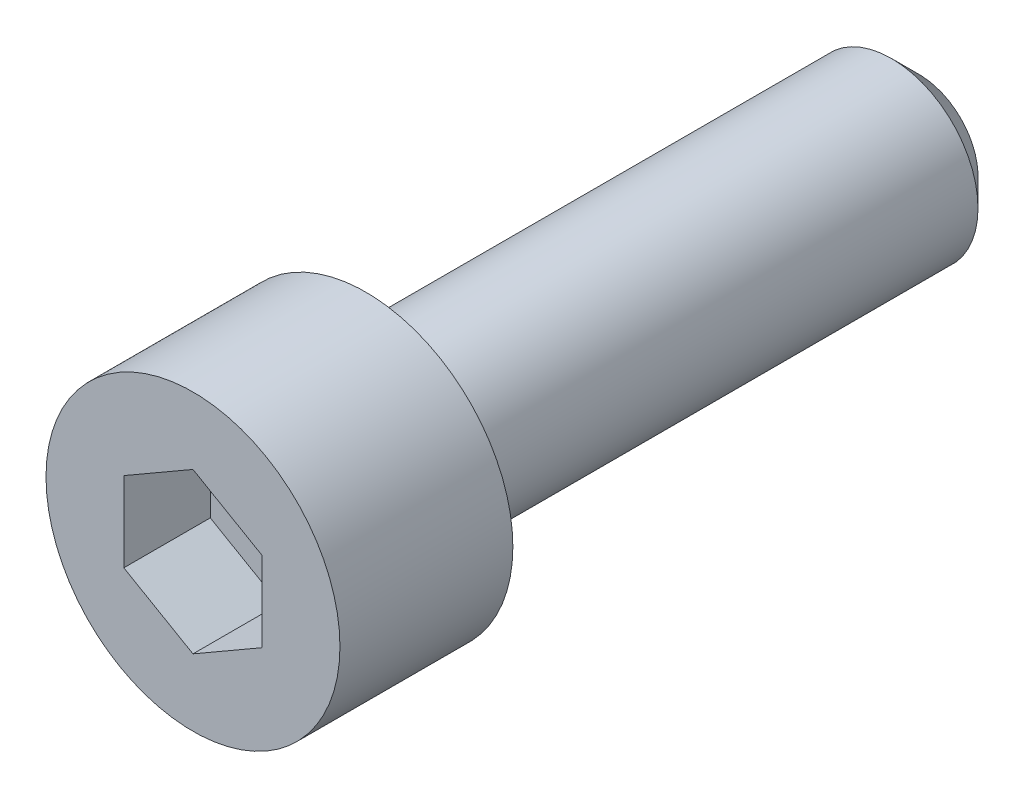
ISO-10303-21;
HEADER;
FILE_DESCRIPTION(('STEP AP214'),'2;1');
FILE_NAME('part.step','',(''),(''),'','','');
FILE_SCHEMA(('AUTOMOTIVE_DESIGN { 1 0 10303 214 1 1 1 1 }'));
ENDSEC;
DATA;
#1=APPLICATION_CONTEXT('core data for automotive mechanical design processes');
#2=APPLICATION_PROTOCOL_DEFINITION('international standard','automotive_design',2000,#1);
#3=PRODUCT_CONTEXT('',#1,'mechanical');
#4=PRODUCT('Part','Part','',(#3));
#5=PRODUCT_RELATED_PRODUCT_CATEGORY('part','',(#4));
#6=PRODUCT_DEFINITION_FORMATION('','',#4);
#7=PRODUCT_DEFINITION_CONTEXT('part definition',#1,'design');
#8=PRODUCT_DEFINITION('design','',#6,#7);
#9=PRODUCT_DEFINITION_SHAPE('','',#8);
#10=(LENGTH_UNIT() NAMED_UNIT(*) SI_UNIT(.MILLI.,.METRE.));
#11=(NAMED_UNIT(*) PLANE_ANGLE_UNIT() SI_UNIT($,.RADIAN.));
#12=(NAMED_UNIT(*) SI_UNIT($,.STERADIAN.) SOLID_ANGLE_UNIT());
#13=UNCERTAINTY_MEASURE_WITH_UNIT(LENGTH_MEASURE(1.E-05),#10,'distance_accuracy_value','');
#14=(GEOMETRIC_REPRESENTATION_CONTEXT(3) GLOBAL_UNCERTAINTY_ASSIGNED_CONTEXT((#13)) GLOBAL_UNIT_ASSIGNED_CONTEXT((#10,
#11,#12)) REPRESENTATION_CONTEXT('',''));
#15=CARTESIAN_POINT('',(0.,0.,0.));
#16=DIRECTION('',(0.,0.,1.));
#17=DIRECTION('',(1.,0.,0.));
#18=AXIS2_PLACEMENT_3D('',#15,#16,#17);
#19=CARTESIAN_POINT('',(0.,2.3094010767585,2.5));
#20=DIRECTION('',(-0.5,-0.86602540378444,0.));
#21=DIRECTION('',(0.86602540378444,-0.5,0.));
#22=AXIS2_PLACEMENT_3D('',#19,#20,#21);
#23=PLANE('',#22);
#24=DIRECTION('',(0.,0.,1.));
#25=VECTOR('',#24,1.);
#26=CARTESIAN_POINT('',(2.,1.15470053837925,2.5));
#27=LINE('',#26,#25);
#28=CARTESIAN_POINT('',(2.,1.15470053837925,2.5));
#29=VERTEX_POINT('',#28);
#30=CARTESIAN_POINT('',(2.,1.15470053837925,5.));
#31=VERTEX_POINT('',#30);
#32=EDGE_CURVE('E63',#29,#31,#27,.T.);
#33=ORIENTED_EDGE('',*,*,#32,.T.);
#34=DIRECTION('',(0.86602540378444,-0.5,0.));
#35=VECTOR('',#34,1.);
#36=CARTESIAN_POINT('',(0.,2.3094010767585,5.));
#37=LINE('',#36,#35);
#38=CARTESIAN_POINT('',(0.,2.3094010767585,5.));
#39=VERTEX_POINT('',#38);
#40=EDGE_CURVE('E29',#39,#31,#37,.T.);
#41=ORIENTED_EDGE('',*,*,#40,.F.);
#42=DIRECTION('',(0.,0.,1.));
#43=VECTOR('',#42,1.);
#44=CARTESIAN_POINT('',(0.,2.3094010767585,2.5));
#45=LINE('',#44,#43);
#46=CARTESIAN_POINT('',(0.,2.3094010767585,2.5));
#47=VERTEX_POINT('',#46);
#48=EDGE_CURVE('E33',#47,#39,#45,.T.);
#49=ORIENTED_EDGE('',*,*,#48,.F.);
#50=DIRECTION('',(0.86602540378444,-0.5,0.));
#51=VECTOR('',#50,1.);
#52=CARTESIAN_POINT('',(0.,2.3094010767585,2.5));
#53=LINE('',#52,#51);
#54=EDGE_CURVE('E65',#47,#29,#53,.T.);
#55=ORIENTED_EDGE('',*,*,#54,.T.);
#56=EDGE_LOOP('',(#33,#41,#49,#55));
#57=FACE_BOUND('',#56,.T.);
#58=ADVANCED_FACE('F14',(#57),#23,.T.);
#59=CARTESIAN_POINT('',(2.,-1.15470053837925,2.5));
#60=DIRECTION('',(1.,0.,0.));
#61=DIRECTION('',(0.,0.,-1.));
#62=AXIS2_PLACEMENT_3D('',#59,#60,#61);
#63=PLANE('',#62);
#64=DIRECTION('',(0.,0.,1.));
#65=VECTOR('',#64,1.);
#66=CARTESIAN_POINT('',(2.,-1.15470053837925,2.5));
#67=LINE('',#66,#65);
#68=CARTESIAN_POINT('',(2.,-1.15470053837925,2.5));
#69=VERTEX_POINT('',#68);
#70=CARTESIAN_POINT('',(2.,-1.15470053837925,5.));
#71=VERTEX_POINT('',#70);
#72=EDGE_CURVE('E70',#69,#71,#67,.T.);
#73=ORIENTED_EDGE('',*,*,#72,.T.);
#74=DIRECTION('',(0.,1.,0.));
#75=VECTOR('',#74,1.);
#76=CARTESIAN_POINT('',(2.,-1.15470053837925,5.));
#77=LINE('',#76,#75);
#78=EDGE_CURVE('E73',#71,#31,#77,.T.);
#79=ORIENTED_EDGE('',*,*,#78,.T.);
#80=ORIENTED_EDGE('',*,*,#32,.F.);
#81=DIRECTION('',(0.,1.,0.));
#82=VECTOR('',#81,1.);
#83=CARTESIAN_POINT('',(2.,-1.15470053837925,2.5));
#84=LINE('',#83,#82);
#85=EDGE_CURVE('E100',#69,#29,#84,.T.);
#86=ORIENTED_EDGE('',*,*,#85,.F.);
#87=EDGE_LOOP('',(#73,#79,#80,#86));
#88=FACE_BOUND('',#87,.T.);
#89=ADVANCED_FACE('F74',(#88),#63,.F.);
#90=CARTESIAN_POINT('',(0.,-2.3094010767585,2.5));
#91=DIRECTION('',(0.5,-0.86602540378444,0.));
#92=DIRECTION('',(0.86602540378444,0.5,0.));
#93=AXIS2_PLACEMENT_3D('',#90,#91,#92);
#94=PLANE('',#93);
#95=DIRECTION('',(0.,0.,1.));
#96=VECTOR('',#95,1.);
#97=CARTESIAN_POINT('',(0.,-2.3094010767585,2.5));
#98=LINE('',#97,#96);
#99=CARTESIAN_POINT('',(0.,-2.3094010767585,2.5));
#100=VERTEX_POINT('',#99);
#101=CARTESIAN_POINT('',(0.,-2.3094010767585,5.));
#102=VERTEX_POINT('',#101);
#103=EDGE_CURVE('E108',#100,#102,#98,.T.);
#104=ORIENTED_EDGE('',*,*,#103,.T.);
#105=DIRECTION('',(0.86602540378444,0.5,0.));
#106=VECTOR('',#105,1.);
#107=CARTESIAN_POINT('',(0.,-2.3094010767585,5.));
#108=LINE('',#107,#106);
#109=EDGE_CURVE('E78',#102,#71,#108,.T.);
#110=ORIENTED_EDGE('',*,*,#109,.T.);
#111=ORIENTED_EDGE('',*,*,#72,.F.);
#112=DIRECTION('',(0.86602540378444,0.5,0.));
#113=VECTOR('',#112,1.);
#114=CARTESIAN_POINT('',(0.,-2.3094010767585,2.5));
#115=LINE('',#114,#113);
#116=EDGE_CURVE('E97',#100,#69,#115,.T.);
#117=ORIENTED_EDGE('',*,*,#116,.F.);
#118=EDGE_LOOP('',(#104,#110,#111,#117));
#119=FACE_BOUND('',#118,.T.);
#120=ADVANCED_FACE('F139',(#119),#94,.F.);
#121=CARTESIAN_POINT('',(0.,-2.3094010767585,2.5));
#122=DIRECTION('',(0.5,0.86602540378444,0.));
#123=DIRECTION('',(-0.86602540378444,0.5,0.));
#124=AXIS2_PLACEMENT_3D('',#121,#122,#123);
#125=PLANE('',#124);
#126=DIRECTION('',(0.,0.,1.));
#127=VECTOR('',#126,1.);
#128=CARTESIAN_POINT('',(-2.,-1.15470053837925,2.5));
#129=LINE('',#128,#127);
#130=CARTESIAN_POINT('',(-2.,-1.15470053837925,2.5));
#131=VERTEX_POINT('',#130);
#132=CARTESIAN_POINT('',(-2.,-1.15470053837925,5.));
#133=VERTEX_POINT('',#132);
#134=EDGE_CURVE('E106',#131,#133,#129,.T.);
#135=ORIENTED_EDGE('',*,*,#134,.T.);
#136=DIRECTION('',(-0.86602540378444,0.5,0.));
#137=VECTOR('',#136,1.);
#138=CARTESIAN_POINT('',(0.,-2.3094010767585,5.));
#139=LINE('',#138,#137);
#140=EDGE_CURVE('E188',#102,#133,#139,.T.);
#141=ORIENTED_EDGE('',*,*,#140,.F.);
#142=ORIENTED_EDGE('',*,*,#103,.F.);
#143=DIRECTION('',(-0.86602540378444,0.5,0.));
#144=VECTOR('',#143,1.);
#145=CARTESIAN_POINT('',(0.,-2.3094010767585,2.5));
#146=LINE('',#145,#144);
#147=EDGE_CURVE('E94',#100,#131,#146,.T.);
#148=ORIENTED_EDGE('',*,*,#147,.T.);
#149=EDGE_LOOP('',(#135,#141,#142,#148));
#150=FACE_BOUND('',#149,.T.);
#151=ADVANCED_FACE('F151',(#150),#125,.T.);
#152=CARTESIAN_POINT('',(-2.,1.15470053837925,2.5));
#153=DIRECTION('',(-1.,0.,0.));
#154=DIRECTION('',(0.,-1.,0.));
#155=AXIS2_PLACEMENT_3D('',#152,#153,#154);
#156=PLANE('',#155);
#157=DIRECTION('',(0.,0.,1.));
#158=VECTOR('',#157,1.);
#159=CARTESIAN_POINT('',(-2.,1.15470053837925,2.5));
#160=LINE('',#159,#158);
#161=CARTESIAN_POINT('',(-2.,1.15470053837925,2.5));
#162=VERTEX_POINT('',#161);
#163=CARTESIAN_POINT('',(-2.,1.15470053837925,5.));
#164=VERTEX_POINT('',#163);
#165=EDGE_CURVE('E104',#162,#164,#160,.T.);
#166=ORIENTED_EDGE('',*,*,#165,.T.);
#167=DIRECTION('',(0.,-1.,0.));
#168=VECTOR('',#167,1.);
#169=CARTESIAN_POINT('',(-2.,1.15470053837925,5.));
#170=LINE('',#169,#168);
#171=EDGE_CURVE('E189',#164,#133,#170,.T.);
#172=ORIENTED_EDGE('',*,*,#171,.T.);
#173=ORIENTED_EDGE('',*,*,#134,.F.);
#174=DIRECTION('',(0.,-1.,0.));
#175=VECTOR('',#174,1.);
#176=CARTESIAN_POINT('',(-2.,1.15470053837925,2.5));
#177=LINE('',#176,#175);
#178=EDGE_CURVE('E91',#162,#131,#177,.T.);
#179=ORIENTED_EDGE('',*,*,#178,.F.);
#180=EDGE_LOOP('',(#166,#172,#173,#179));
#181=FACE_BOUND('',#180,.T.);
#182=ADVANCED_FACE('F147',(#181),#156,.F.);
#183=CARTESIAN_POINT('',(0.,2.3094010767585,2.5));
#184=DIRECTION('',(-0.5,0.86602540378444,0.));
#185=DIRECTION('',(-0.86602540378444,-0.5,0.));
#186=AXIS2_PLACEMENT_3D('',#183,#184,#185);
#187=PLANE('',#186);
#188=DIRECTION('',(-0.86602540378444,-0.5,0.));
#189=VECTOR('',#188,1.);
#190=CARTESIAN_POINT('',(0.,2.3094010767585,2.5));
#191=LINE('',#190,#189);
#192=EDGE_CURVE('E88',#47,#162,#191,.T.);
#193=ORIENTED_EDGE('',*,*,#192,.F.);
#194=ORIENTED_EDGE('',*,*,#48,.T.);
#195=DIRECTION('',(-0.86602540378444,-0.5,0.));
#196=VECTOR('',#195,1.);
#197=CARTESIAN_POINT('',(0.,2.3094010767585,5.));
#198=LINE('',#197,#196);
#199=EDGE_CURVE('E84',#39,#164,#198,.T.);
#200=ORIENTED_EDGE('',*,*,#199,.T.);
#201=ORIENTED_EDGE('',*,*,#165,.F.);
#202=EDGE_LOOP('',(#193,#194,#200,#201));
#203=FACE_BOUND('',#202,.T.);
#204=ADVANCED_FACE('F144',(#203),#187,.F.);
#205=CARTESIAN_POINT('',(-2.,3.46410161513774,2.5));
#206=DIRECTION('',(0.,0.,-1.));
#207=DIRECTION('',(-1.,0.,0.));
#208=AXIS2_PLACEMENT_3D('',#205,#206,#207);
#209=PLANE('',#208);
#210=ORIENTED_EDGE('',*,*,#54,.F.);
#211=ORIENTED_EDGE('',*,*,#192,.T.);
#212=ORIENTED_EDGE('',*,*,#178,.T.);
#213=ORIENTED_EDGE('',*,*,#147,.F.);
#214=ORIENTED_EDGE('',*,*,#116,.T.);
#215=ORIENTED_EDGE('',*,*,#85,.T.);
#216=EDGE_LOOP('',(#210,#211,#212,#213,#214,#215));
#217=FACE_BOUND('',#216,.T.);
#218=ADVANCED_FACE('F143',(#217),#209,.F.);
#219=CARTESIAN_POINT('',(0.,0.,5.));
#220=DIRECTION('',(0.,0.,1.));
#221=DIRECTION('',(1.,0.,0.));
#222=AXIS2_PLACEMENT_3D('',#219,#220,#221);
#223=PLANE('',#222);
#224=CARTESIAN_POINT('',(0.,0.,5.));
#225=DIRECTION('',(0.,0.,1.));
#226=DIRECTION('',(1.,0.,0.));
#227=AXIS2_PLACEMENT_3D('',#224,#225,#226);
#228=CIRCLE('',#227,4.25);
#229=CARTESIAN_POINT('',(4.25,0.,5.));
#230=VERTEX_POINT('',#229);
#231=EDGE_CURVE('E116',#230,#230,#228,.T.);
#232=ORIENTED_EDGE('',*,*,#231,.T.);
#233=EDGE_LOOP('',(#232));
#234=FACE_BOUND('',#233,.T.);
#235=ORIENTED_EDGE('',*,*,#199,.F.);
#236=ORIENTED_EDGE('',*,*,#40,.T.);
#237=ORIENTED_EDGE('',*,*,#78,.F.);
#238=ORIENTED_EDGE('',*,*,#109,.F.);
#239=ORIENTED_EDGE('',*,*,#140,.T.);
#240=ORIENTED_EDGE('',*,*,#171,.F.);
#241=EDGE_LOOP('',(#235,#236,#237,#238,#239,#240));
#242=FACE_BOUND('',#241,.T.);
#243=ADVANCED_FACE('F81',(#234,#242),#223,.T.);
#244=CARTESIAN_POINT('',(0.,0.,5.));
#245=DIRECTION('',(0.,0.,1.));
#246=DIRECTION('',(1.,0.,0.));
#247=AXIS2_PLACEMENT_3D('',#244,#245,#246);
#248=CYLINDRICAL_SURFACE('',#247,4.25);
#249=CARTESIAN_POINT('',(0.,0.,0.));
#250=DIRECTION('',(0.,0.,1.));
#251=DIRECTION('',(1.,0.,0.));
#252=AXIS2_PLACEMENT_3D('',#249,#250,#251);
#253=CIRCLE('',#252,4.25);
#254=CARTESIAN_POINT('',(4.25,0.,0.));
#255=VERTEX_POINT('',#254);
#256=EDGE_CURVE('E113',#255,#255,#253,.T.);
#257=ORIENTED_EDGE('',*,*,#256,.T.);
#258=EDGE_LOOP('',(#257));
#259=FACE_BOUND('',#258,.T.);
#260=ORIENTED_EDGE('',*,*,#231,.F.);
#261=EDGE_LOOP('',(#260));
#262=FACE_BOUND('',#261,.T.);
#263=ADVANCED_FACE('F165',(#259,#262),#248,.T.);
#264=CARTESIAN_POINT('',(4.25,0.,0.));
#265=DIRECTION('',(0.,0.,-1.));
#266=DIRECTION('',(-1.,0.,0.));
#267=AXIS2_PLACEMENT_3D('',#264,#265,#266);
#268=PLANE('',#267);
#269=CARTESIAN_POINT('',(0.,0.,0.));
#270=DIRECTION('',(0.,0.,1.));
#271=DIRECTION('',(1.,0.,0.));
#272=AXIS2_PLACEMENT_3D('',#269,#270,#271);
#273=CIRCLE('',#272,2.5);
#274=CARTESIAN_POINT('',(2.5,0.,0.));
#275=VERTEX_POINT('',#274);
#276=EDGE_CURVE('E69',#275,#275,#273,.T.);
#277=ORIENTED_EDGE('',*,*,#276,.T.);
#278=EDGE_LOOP('',(#277));
#279=FACE_BOUND('',#278,.T.);
#280=ORIENTED_EDGE('',*,*,#256,.F.);
#281=EDGE_LOOP('',(#280));
#282=FACE_BOUND('',#281,.T.);
#283=ADVANCED_FACE('F161',(#279,#282),#268,.T.);
#284=CARTESIAN_POINT('',(0.,0.,5.));
#285=DIRECTION('',(0.,0.,1.));
#286=DIRECTION('',(1.,0.,0.));
#287=AXIS2_PLACEMENT_3D('',#284,#285,#286);
#288=CYLINDRICAL_SURFACE('',#287,2.5);
#289=CARTESIAN_POINT('',(0.,0.,-15.2));
#290=DIRECTION('',(0.,0.,-1.));
#291=DIRECTION('',(-1.,0.,0.));
#292=AXIS2_PLACEMENT_3D('',#289,#290,#291);
#293=CIRCLE('',#292,2.5);
#294=CARTESIAN_POINT('',(-2.5,0.,-15.2));
#295=VERTEX_POINT('',#294);
#296=EDGE_CURVE('E9',#295,#295,#293,.F.);
#297=ORIENTED_EDGE('',*,*,#296,.T.);
#298=EDGE_LOOP('',(#297));
#299=FACE_BOUND('',#298,.T.);
#300=ORIENTED_EDGE('',*,*,#276,.F.);
#301=EDGE_LOOP('',(#300));
#302=FACE_BOUND('',#301,.T.);
#303=ADVANCED_FACE('F130',(#299,#302),#288,.T.);
#304=CARTESIAN_POINT('',(0.,0.,-16.));
#305=DIRECTION('',(0.,0.,-1.));
#306=DIRECTION('',(-1.,0.,0.));
#307=AXIS2_PLACEMENT_3D('',#304,#305,#306);
#308=PLANE('',#307);
#309=CARTESIAN_POINT('',(0.,0.,-16.));
#310=DIRECTION('',(0.,0.,-1.));
#311=DIRECTION('',(-1.,0.,0.));
#312=AXIS2_PLACEMENT_3D('',#309,#310,#311);
#313=CIRCLE('',#312,1.7);
#314=CARTESIAN_POINT('',(-1.7,0.,-16.));
#315=VERTEX_POINT('',#314);
#316=EDGE_CURVE('E22',#315,#315,#313,.T.);
#317=ORIENTED_EDGE('',*,*,#316,.T.);
#318=EDGE_LOOP('',(#317));
#319=FACE_BOUND('',#318,.T.);
#320=ADVANCED_FACE('F121',(#319),#308,.T.);
#321=CARTESIAN_POINT('',(0.,0.,-16.));
#322=DIRECTION('',(0.,0.,1.));
#323=DIRECTION('',(1.,0.,0.));
#324=AXIS2_PLACEMENT_3D('',#321,#322,#323);
#325=CONICAL_SURFACE('',#324,1.7,0.785398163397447);
#326=ORIENTED_EDGE('',*,*,#296,.F.);
#327=EDGE_LOOP('',(#326));
#328=FACE_BOUND('',#327,.T.);
#329=ORIENTED_EDGE('',*,*,#316,.F.);
#330=EDGE_LOOP('',(#329));
#331=FACE_BOUND('',#330,.T.);
#332=ADVANCED_FACE('F16',(#328,#331),#325,.T.);
#333=CLOSED_SHELL('',(#58,#89,#120,#151,#182,#204,#218,#243,#263,#283,#303,#320,#332));
#334=MANIFOLD_SOLID_BREP('B1',#333);
#335=ADVANCED_BREP_SHAPE_REPRESENTATION('',(#18,#334),#14);
#336=SHAPE_DEFINITION_REPRESENTATION(#9,#335);
ENDSEC;
END-ISO-10303-21;
